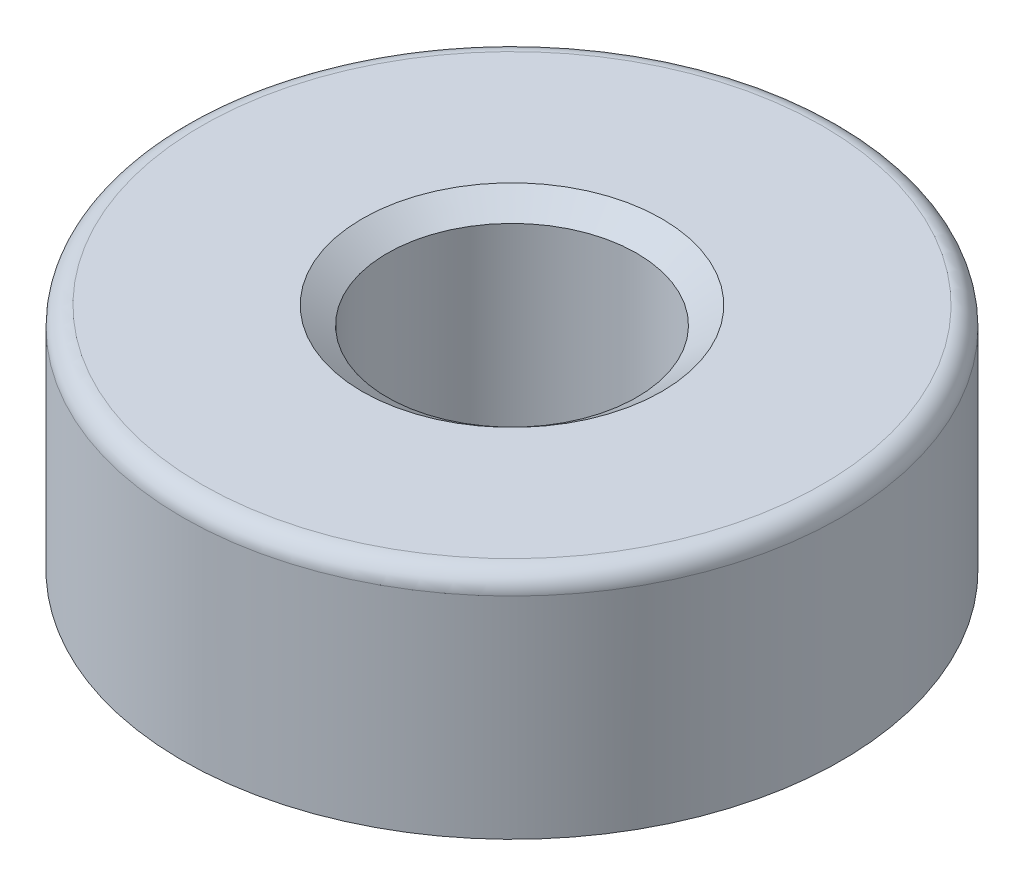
from build123d import *

# Parameters (mm, degrees)
LUGGAP_DEPTH    = 6.35
LUGGAPPAT_COUNT = 3


with BuildPart() as part:
    # BodySke → Body (revolve)
    with BuildSketch(Plane.XY, mode=Mode.PRIVATE) as body_sk:
        with BuildLine():
            Line((4.015, 0), (4.875805, 0))
            Line((4.875805, 0), (5.739195, -0.62))
            Line((5.739195, -0.62), (6.6, 0))
            Line((6.6, 0), (6.6, 4.219))
            ThreePointArc((6.6, 4.219), (6.488407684, 4.488407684), (6.219, 4.6))
            Line((6.219, 4.6), (2.5, 4.6))
            Line((2.5, 4.6), (2.5, -1.24))
            Line((2.5, -1.24), (4.015, -1.24))
            Line((4.015, -1.24), (4.015, 0))
        make_face()
    revolve(body_sk.sketch.rotate(Axis((0, 4.219, 0), (0, 1, 0)), 90), axis=Axis((0, 4.219, 0), (0, 1, 0)))

    # EndChamferSke → EndChamfer (revolve, cut)
    with BuildSketch(Plane.XY, mode=Mode.PRIVATE) as endchamfer_sk:
        Polygon((3, -1.494), (3, -0.986), (2.5, -0.636026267), (2.5, -1.494), align=None)
        Polygon((3, 4.6), (2.5, 4.250026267), (2.5, 4.6), align=None)
    revolve(endchamfer_sk.sketch.rotate(Axis((0, -2.54, 0), (0, 1, 0)), 90), axis=Axis((0, -2.54, 0), (0, 1, 0)), mode=Mode.SUBTRACT)

    # LugGapSke → LugGap (cut)
    with BuildSketch(Plane(origin=(0, 0, 0), x_dir=(1, 0, 0), z_dir=(0, 1, 0))):
        with BuildLine():
            Line((-1.020631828, -4.767786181), (-1.914604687, -6.316192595))
            ThreePointArc((-1.914604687, -6.316192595), (3.3, -5.715767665), (6.427285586, -1.5))
            Line((6.427285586, -1.5), (4.639339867, -1.5))
            ThreePointArc((4.639339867, -1.5), (2.4379025, -4.222570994), (-1.020631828, -4.767786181))
        make_face()
    luggap = extrude(amount=-LUGGAP_DEPTH, mode=Mode.SUBTRACT)

    # LugGapPat: LugGap ×3 about axis
    luggappat_axis = Axis((0, 0, 0), (0, 1, 0))
    for i in range(1, LUGGAPPAT_COUNT):
        add(luggap.rotate(luggappat_axis, i * 360 / LUGGAPPAT_COUNT), mode=Mode.SUBTRACT)


solid = part.part
